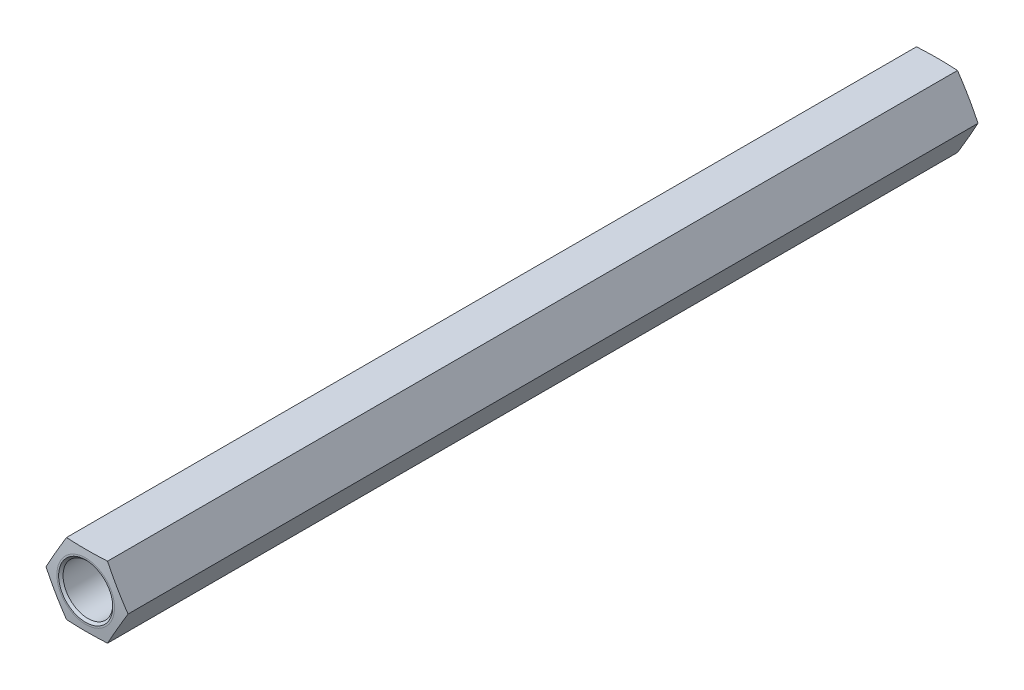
ISO-10303-21;
HEADER;
FILE_DESCRIPTION(('STEP AP214'),'2;1');
FILE_NAME('part.step','',(''),(''),'','','');
FILE_SCHEMA(('AUTOMOTIVE_DESIGN { 1 0 10303 214 1 1 1 1 }'));
ENDSEC;
DATA;
#1=APPLICATION_CONTEXT('core data for automotive mechanical design processes');
#2=APPLICATION_PROTOCOL_DEFINITION('international standard','automotive_design',2000,#1);
#3=PRODUCT_CONTEXT('',#1,'mechanical');
#4=PRODUCT('Part','Part','',(#3));
#5=PRODUCT_RELATED_PRODUCT_CATEGORY('part','',(#4));
#6=PRODUCT_DEFINITION_FORMATION('','',#4);
#7=PRODUCT_DEFINITION_CONTEXT('part definition',#1,'design');
#8=PRODUCT_DEFINITION('design','',#6,#7);
#9=PRODUCT_DEFINITION_SHAPE('','',#8);
#10=(LENGTH_UNIT() NAMED_UNIT(*) SI_UNIT(.MILLI.,.METRE.));
#11=(NAMED_UNIT(*) PLANE_ANGLE_UNIT() SI_UNIT($,.RADIAN.));
#12=(NAMED_UNIT(*) SI_UNIT($,.STERADIAN.) SOLID_ANGLE_UNIT());
#13=UNCERTAINTY_MEASURE_WITH_UNIT(LENGTH_MEASURE(1.E-05),#10,'distance_accuracy_value','');
#14=(GEOMETRIC_REPRESENTATION_CONTEXT(3) GLOBAL_UNCERTAINTY_ASSIGNED_CONTEXT((#13)) GLOBAL_UNIT_ASSIGNED_CONTEXT((#10,
#11,#12)) REPRESENTATION_CONTEXT('',''));
#15=CARTESIAN_POINT('',(0.,0.,0.));
#16=DIRECTION('',(0.,0.,1.));
#17=DIRECTION('',(1.,0.,0.));
#18=AXIS2_PLACEMENT_3D('',#15,#16,#17);
#19=CARTESIAN_POINT('',(3.6427233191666E-08,6.34999999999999,38.1));
#20=DIRECTION('',(0.,0.,-1.));
#21=DIRECTION('',(-1.,0.,0.));
#22=AXIS2_PLACEMENT_3D('',#19,#20,#21);
#23=PLANE('',#22);
#24=CARTESIAN_POINT('',(0.,-6.30938595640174E-08,38.1));
#25=DIRECTION('',(0.,0.,1.));
#26=DIRECTION('',(1.,0.,0.));
#27=AXIS2_PLACEMENT_3D('',#24,#25,#26);
#28=CIRCLE('',#27,2.57273925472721);
#29=CARTESIAN_POINT('',(2.57273925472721,-6.30938595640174E-08,38.1));
#30=VERTEX_POINT('',#29);
#31=EDGE_CURVE('E102',#30,#30,#28,.T.);
#32=ORIENTED_EDGE('',*,*,#31,.T.);
#33=EDGE_LOOP('',(#32));
#34=FACE_BOUND('',#33,.T.);
#35=CARTESIAN_POINT('',(0.,-6.30938595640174E-08,38.1));
#36=DIRECTION('',(0.,0.,-1.));
#37=DIRECTION('',(-1.,0.,0.));
#38=AXIS2_PLACEMENT_3D('',#35,#36,#37);
#39=CIRCLE('',#38,2.42000000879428);
#40=CARTESIAN_POINT('',(-2.42000000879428,-6.30938595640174E-08,38.1));
#41=VERTEX_POINT('',#40);
#42=EDGE_CURVE('E124',#41,#41,#39,.T.);
#43=ORIENTED_EDGE('',*,*,#42,.T.);
#44=EDGE_LOOP('',(#43));
#45=FACE_BOUND('',#44,.T.);
#46=ADVANCED_FACE('F30',(#34,#45),#23,.F.);
#47=CARTESIAN_POINT('',(3.6427233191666E-08,6.34999999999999,-38.1));
#48=DIRECTION('',(0.,0.,-1.));
#49=DIRECTION('',(-1.,0.,0.));
#50=AXIS2_PLACEMENT_3D('',#47,#48,#49);
#51=PLANE('',#50);
#52=CARTESIAN_POINT('',(0.,-6.30938595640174E-08,-38.1));
#53=DIRECTION('',(0.,0.,1.));
#54=DIRECTION('',(1.,0.,0.));
#55=AXIS2_PLACEMENT_3D('',#52,#53,#54);
#56=CIRCLE('',#55,2.57273925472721);
#57=CARTESIAN_POINT('',(2.57273925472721,-6.30938595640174E-08,-38.1));
#58=VERTEX_POINT('',#57);
#59=EDGE_CURVE('E222',#58,#58,#56,.T.);
#60=ORIENTED_EDGE('',*,*,#59,.F.);
#61=EDGE_LOOP('',(#60));
#62=FACE_BOUND('',#61,.T.);
#63=CARTESIAN_POINT('',(0.,-6.30938595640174E-08,-38.1));
#64=DIRECTION('',(0.,0.,-1.));
#65=DIRECTION('',(-1.,0.,0.));
#66=AXIS2_PLACEMENT_3D('',#63,#64,#65);
#67=CIRCLE('',#66,2.42000000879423);
#68=CARTESIAN_POINT('',(-2.42000000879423,-6.30938595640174E-08,-38.1));
#69=VERTEX_POINT('',#68);
#70=EDGE_CURVE('E127',#69,#69,#67,.F.);
#71=ORIENTED_EDGE('',*,*,#70,.T.);
#72=EDGE_LOOP('',(#71));
#73=FACE_BOUND('',#72,.T.);
#74=ADVANCED_FACE('F144',(#62,#73),#51,.T.);
#75=CARTESIAN_POINT('',(-1.83308710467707,3.17499993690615,38.1));
#76=DIRECTION('',(0.866025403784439,-0.5,0.));
#77=DIRECTION('',(0.5,0.866025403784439,0.));
#78=AXIS2_PLACEMENT_3D('',#75,#76,#77);
#79=PLANE('',#78);
#80=DIRECTION('',(0.,0.,-1.));
#81=VECTOR('',#80,1.);
#82=CARTESIAN_POINT('',(-3.66617420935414,-6.30938550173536E-08,38.1));
#83=LINE('',#82,#81);
#84=CARTESIAN_POINT('',(-3.66617420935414,-6.30938550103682E-08,37.98));
#85=VERTEX_POINT('',#84);
#86=CARTESIAN_POINT('',(-3.66617420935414,-6.30938550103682E-08,-37.98));
#87=VERTEX_POINT('',#86);
#88=EDGE_CURVE('E116',#85,#87,#83,.T.);
#89=ORIENTED_EDGE('',*,*,#88,.F.);
#90=CARTESIAN_POINT('',(-3.66628967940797,-0.000200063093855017,37.9799873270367));
#91=CARTESIAN_POINT('',(-3.58994462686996,0.132033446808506,37.9883701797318));
#92=CARTESIAN_POINT('',(-3.51357601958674,0.264307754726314,37.9959650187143));
#93=CARTESIAN_POINT('',(-3.36079345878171,0.528934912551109,38.0092901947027));
#94=CARTESIAN_POINT('',(-3.28437950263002,0.661287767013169,38.0150204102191));
#95=CARTESIAN_POINT('',(-3.13158459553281,0.925936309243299,38.0243226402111));
#96=CARTESIAN_POINT('',(-3.05520367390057,1.05823194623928,38.0278965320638));
#97=CARTESIAN_POINT('',(-2.90242538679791,1.32285170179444,38.0326873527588));
#98=CARTESIAN_POINT('',(-2.82602802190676,1.45517581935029,38.0339043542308));
#99=CARTESIAN_POINT('',(-2.67323329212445,1.719824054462,38.0339043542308));
#100=CARTESIAN_POINT('',(-2.5968359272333,1.85214817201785,38.0326873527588));
#101=CARTESIAN_POINT('',(-2.44405764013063,2.11676792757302,38.0278965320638));
#102=CARTESIAN_POINT('',(-2.36767671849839,2.249063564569,38.0243226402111));
#103=CARTESIAN_POINT('',(-2.21488181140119,2.51371210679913,38.0150204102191));
#104=CARTESIAN_POINT('',(-2.1384678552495,2.64606496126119,38.0092901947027));
#105=CARTESIAN_POINT('',(-1.98568529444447,2.91069211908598,37.9959650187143));
#106=CARTESIAN_POINT('',(-1.90931668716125,3.04296642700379,37.9883701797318));
#107=CARTESIAN_POINT('',(-1.83297163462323,3.17519993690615,37.9799873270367));
#108=B_SPLINE_CURVE_WITH_KNOTS('',3,(#90,#91,#92,#93,#94,#95,#96,#97,#98,#99,#100,#101,#102,
#103,#104,#105,#106,#107),.UNSPECIFIED.,.F.,.F.,(4,2,2,2,2,2,2,2,4),(0.,0.458763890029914,
0.917557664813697,1.37595141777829,1.83433104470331,2.29271067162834,2.75110442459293,
3.20989819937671,3.66866208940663),.UNSPECIFIED.);
#109=CARTESIAN_POINT('',(-1.83308710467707,3.17499993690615,37.98));
#110=VERTEX_POINT('',#109);
#111=EDGE_CURVE('E187',#85,#110,#108,.T.);
#112=ORIENTED_EDGE('',*,*,#111,.T.);
#113=DIRECTION('',(0.,0.,-1.));
#114=VECTOR('',#113,1.);
#115=CARTESIAN_POINT('',(-1.83308710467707,3.17499993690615,38.1));
#116=LINE('',#115,#114);
#117=CARTESIAN_POINT('',(-1.83308710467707,3.17499993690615,-37.98));
#118=VERTEX_POINT('',#117);
#119=EDGE_CURVE('E57',#110,#118,#116,.T.);
#120=ORIENTED_EDGE('',*,*,#119,.T.);
#121=CARTESIAN_POINT('',(-1.83297163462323,3.17519993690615,-37.9799873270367));
#122=CARTESIAN_POINT('',(-1.90931668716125,3.04296642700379,-37.9883701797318));
#123=CARTESIAN_POINT('',(-1.98568529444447,2.91069211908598,-37.9959650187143));
#124=CARTESIAN_POINT('',(-2.1384678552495,2.64606496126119,-38.0092901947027));
#125=CARTESIAN_POINT('',(-2.21488181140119,2.51371210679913,-38.0150204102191));
#126=CARTESIAN_POINT('',(-2.36767671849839,2.249063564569,-38.0243226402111));
#127=CARTESIAN_POINT('',(-2.44405764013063,2.11676792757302,-38.0278965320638));
#128=CARTESIAN_POINT('',(-2.5968359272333,1.85214817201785,-38.0326873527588));
#129=CARTESIAN_POINT('',(-2.67323329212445,1.719824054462,-38.0339043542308));
#130=CARTESIAN_POINT('',(-2.82602802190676,1.45517581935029,-38.0339043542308));
#131=CARTESIAN_POINT('',(-2.90242538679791,1.32285170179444,-38.0326873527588));
#132=CARTESIAN_POINT('',(-3.05520367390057,1.05823194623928,-38.0278965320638));
#133=CARTESIAN_POINT('',(-3.13158459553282,0.925936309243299,-38.0243226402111));
#134=CARTESIAN_POINT('',(-3.28437950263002,0.661287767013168,-38.0150204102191));
#135=CARTESIAN_POINT('',(-3.36079345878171,0.528934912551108,-38.0092901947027));
#136=CARTESIAN_POINT('',(-3.51357601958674,0.264307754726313,-37.9959650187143));
#137=CARTESIAN_POINT('',(-3.58994462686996,0.132033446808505,-37.9883701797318));
#138=CARTESIAN_POINT('',(-3.66628967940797,-0.000200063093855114,-37.9799873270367));
#139=B_SPLINE_CURVE_WITH_KNOTS('',3,(#121,#122,#123,#124,#125,#126,#127,#128,#129,#130,#131,
#132,#133,#134,#135,#136,#137,#138),.UNSPECIFIED.,.F.,.F.,(4,2,2,2,2,2,2,2,4),(0.,
0.458763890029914,0.917557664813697,1.37595141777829,1.83433104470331,2.29271067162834,
2.75110442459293,3.20989819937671,3.66866208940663),.UNSPECIFIED.);
#140=EDGE_CURVE('E209',#118,#87,#139,.T.);
#141=ORIENTED_EDGE('',*,*,#140,.T.);
#142=EDGE_LOOP('',(#89,#112,#120,#141));
#143=FACE_BOUND('',#142,.T.);
#144=ADVANCED_FACE('F196',(#143),#79,.F.);
#145=CARTESIAN_POINT('',(-3.66617420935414,-6.30938550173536E-08,38.1));
#146=DIRECTION('',(0.866025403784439,0.5,0.));
#147=DIRECTION('',(-0.5,0.866025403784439,0.));
#148=AXIS2_PLACEMENT_3D('',#145,#146,#147);
#149=PLANE('',#148);
#150=DIRECTION('',(0.,0.,-1.));
#151=VECTOR('',#150,1.);
#152=CARTESIAN_POINT('',(-1.83308710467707,-3.17500006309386,38.1));
#153=LINE('',#152,#151);
#154=CARTESIAN_POINT('',(-1.83308710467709,-3.17500006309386,37.98));
#155=VERTEX_POINT('',#154);
#156=CARTESIAN_POINT('',(-1.83308710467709,-3.17500006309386,-37.98));
#157=VERTEX_POINT('',#156);
#158=EDGE_CURVE('E110',#155,#157,#153,.T.);
#159=ORIENTED_EDGE('',*,*,#158,.F.);
#160=CARTESIAN_POINT('',(-1.83297163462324,-3.17520006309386,37.9799873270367));
#161=CARTESIAN_POINT('',(-1.90931668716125,-3.0429665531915,37.9883701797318));
#162=CARTESIAN_POINT('',(-1.98568529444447,-2.91069224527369,37.9959650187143));
#163=CARTESIAN_POINT('',(-2.1384678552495,-2.6460650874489,38.0092901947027));
#164=CARTESIAN_POINT('',(-2.21488181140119,-2.51371223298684,38.0150204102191));
#165=CARTESIAN_POINT('',(-2.36767671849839,-2.24906369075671,38.0243226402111));
#166=CARTESIAN_POINT('',(-2.44405764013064,-2.11676805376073,38.0278965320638));
#167=CARTESIAN_POINT('',(-2.5968359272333,-1.85214829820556,38.0326873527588));
#168=CARTESIAN_POINT('',(-2.67323329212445,-1.71982418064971,38.0339043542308));
#169=CARTESIAN_POINT('',(-2.82602802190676,-1.455175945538,38.0339043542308));
#170=CARTESIAN_POINT('',(-2.90242538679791,-1.32285182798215,38.0326873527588));
#171=CARTESIAN_POINT('',(-3.05520367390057,-1.05823207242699,38.0278965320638));
#172=CARTESIAN_POINT('',(-3.13158459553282,-0.925936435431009,38.0243226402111));
#173=CARTESIAN_POINT('',(-3.28437950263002,-0.661287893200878,38.0150204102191));
#174=CARTESIAN_POINT('',(-3.36079345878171,-0.528935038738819,38.0092901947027));
#175=CARTESIAN_POINT('',(-3.51357601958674,-0.264307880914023,37.9959650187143));
#176=CARTESIAN_POINT('',(-3.58994462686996,-0.132033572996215,37.9883701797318));
#177=CARTESIAN_POINT('',(-3.66628967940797,0.000199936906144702,37.9799873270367));
#178=B_SPLINE_CURVE_WITH_KNOTS('',3,(#160,#161,#162,#163,#164,#165,#166,#167,#168,#169,#170,
#171,#172,#173,#174,#175,#176,#177),.UNSPECIFIED.,.F.,.F.,(4,2,2,2,2,2,2,2,4),(0.,
0.458763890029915,0.917557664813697,1.37595141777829,1.83433104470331,2.29271067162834,
2.75110442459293,3.20989819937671,3.66866208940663),.UNSPECIFIED.);
#179=EDGE_CURVE('E181',#155,#85,#178,.T.);
#180=ORIENTED_EDGE('',*,*,#179,.T.);
#181=ORIENTED_EDGE('',*,*,#88,.T.);
#182=CARTESIAN_POINT('',(-3.66628967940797,0.000199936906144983,-37.9799873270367));
#183=CARTESIAN_POINT('',(-3.58994462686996,-0.132033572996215,-37.9883701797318));
#184=CARTESIAN_POINT('',(-3.51357601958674,-0.264307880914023,-37.9959650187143));
#185=CARTESIAN_POINT('',(-3.36079345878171,-0.528935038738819,-38.0092901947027));
#186=CARTESIAN_POINT('',(-3.28437950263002,-0.661287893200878,-38.0150204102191));
#187=CARTESIAN_POINT('',(-3.13158459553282,-0.925936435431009,-38.0243226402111));
#188=CARTESIAN_POINT('',(-3.05520367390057,-1.05823207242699,-38.0278965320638));
#189=CARTESIAN_POINT('',(-2.90242538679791,-1.32285182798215,-38.0326873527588));
#190=CARTESIAN_POINT('',(-2.82602802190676,-1.455175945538,-38.0339043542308));
#191=CARTESIAN_POINT('',(-2.67323329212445,-1.71982418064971,-38.0339043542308));
#192=CARTESIAN_POINT('',(-2.5968359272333,-1.85214829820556,-38.0326873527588));
#193=CARTESIAN_POINT('',(-2.44405764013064,-2.11676805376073,-38.0278965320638));
#194=CARTESIAN_POINT('',(-2.36767671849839,-2.24906369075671,-38.0243226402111));
#195=CARTESIAN_POINT('',(-2.21488181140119,-2.51371223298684,-38.0150204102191));
#196=CARTESIAN_POINT('',(-2.1384678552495,-2.6460650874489,-38.0092901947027));
#197=CARTESIAN_POINT('',(-1.98568529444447,-2.91069224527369,-37.9959650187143));
#198=CARTESIAN_POINT('',(-1.90931668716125,-3.0429665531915,-37.9883701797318));
#199=CARTESIAN_POINT('',(-1.83297163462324,-3.17520006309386,-37.9799873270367));
#200=B_SPLINE_CURVE_WITH_KNOTS('',3,(#182,#183,#184,#185,#186,#187,#188,#189,#190,#191,#192,
#193,#194,#195,#196,#197,#198,#199),.UNSPECIFIED.,.F.,.F.,(4,2,2,2,2,2,2,2,4),(0.,
0.458763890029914,0.917557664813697,1.37595141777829,1.83433104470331,2.29271067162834,
2.75110442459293,3.20989819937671,3.66866208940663),.UNSPECIFIED.);
#201=EDGE_CURVE('E202',#87,#157,#200,.T.);
#202=ORIENTED_EDGE('',*,*,#201,.T.);
#203=EDGE_LOOP('',(#159,#180,#181,#202));
#204=FACE_BOUND('',#203,.T.);
#205=ADVANCED_FACE('F192',(#204),#149,.F.);
#206=CARTESIAN_POINT('',(-1.83308710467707,-3.17500006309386,38.1));
#207=DIRECTION('',(-3.44194550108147E-08,0.999999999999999,0.));
#208=DIRECTION('',(-0.999999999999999,-3.44194550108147E-08,0.));
#209=AXIS2_PLACEMENT_3D('',#206,#207,#208);
#210=PLANE('',#209);
#211=DIRECTION('',(0.,0.,-1.));
#212=VECTOR('',#211,1.);
#213=CARTESIAN_POINT('',(1.83308710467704,-3.17499993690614,38.1));
#214=LINE('',#213,#212);
#215=CARTESIAN_POINT('',(1.83308699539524,-3.17500012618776,37.98));
#216=VERTEX_POINT('',#215);
#217=CARTESIAN_POINT('',(1.83308699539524,-3.17500012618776,-37.98));
#218=VERTEX_POINT('',#217);
#219=EDGE_CURVE('E108',#216,#218,#214,.T.);
#220=ORIENTED_EDGE('',*,*,#219,.F.);
#221=CARTESIAN_POINT('',(-4.83494791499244,-3.17500016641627,37.7475517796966));
#222=CARTESIAN_POINT('',(-4.69083344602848,-3.17500016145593,37.7607700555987));
#223=CARTESIAN_POINT('',(-4.54670317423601,-3.17500015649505,37.7738162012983));
#224=CARTESIAN_POINT('',(-4.25840335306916,-3.17500014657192,37.7994791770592));
#225=CARTESIAN_POINT('',(-4.11423380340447,-3.17500014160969,37.8120960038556));
#226=CARTESIAN_POINT('',(-3.68161123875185,-3.17500012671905,37.8491786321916));
#227=CARTESIAN_POINT('',(-3.39309105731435,-3.17500011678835,37.8728722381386));
#228=CARTESIAN_POINT('',(-2.81617995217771,-3.17500009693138,37.9171363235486));
#229=CARTESIAN_POINT('',(-2.52778933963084,-3.17500008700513,37.9377107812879));
#230=CARTESIAN_POINT('',(-1.95071438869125,-3.17500006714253,37.974212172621));
#231=CARTESIAN_POINT('',(-1.66203005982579,-3.17500005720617,37.9901392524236));
#232=CARTESIAN_POINT('',(-1.08383678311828,-3.17500003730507,38.0153055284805));
#233=CARTESIAN_POINT('',(-0.794327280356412,-3.17500002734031,38.0245328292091));
#234=CARTESIAN_POINT('',(-0.359965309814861,-3.17500001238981,38.0320264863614));
#235=CARTESIAN_POINT('',(-0.215165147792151,-3.17500000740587,38.0334665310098));
#236=CARTESIAN_POINT('',(0.0744404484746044,-3.1749999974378,38.0341710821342));
#237=CARTESIAN_POINT('',(0.219245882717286,-3.17499999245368,38.0334355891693));
#238=CARTESIAN_POINT('',(0.653794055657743,-3.17499997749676,38.0279910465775));
#239=CARTESIAN_POINT('',(0.943499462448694,-3.17499996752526,38.0200410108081));
#240=CARTESIAN_POINT('',(1.52263859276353,-3.17499994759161,37.9970571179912));
#241=CARTESIAN_POINT('',(1.8120722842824,-3.17499993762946,37.9820225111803));
#242=CARTESIAN_POINT('',(2.37658945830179,-3.17499991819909,37.9478298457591));
#243=CARTESIAN_POINT('',(2.65168769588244,-3.17499990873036,37.9289073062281));
#244=CARTESIAN_POINT('',(3.20165867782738,-3.17499988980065,37.8879990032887));
#245=CARTESIAN_POINT('',(3.47653141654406,-3.17499988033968,37.8660131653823));
#246=CARTESIAN_POINT('',(4.02611836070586,-3.1749998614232,37.819972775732));
#247=CARTESIAN_POINT('',(4.30083255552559,-3.17499985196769,37.7959180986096));
#248=CARTESIAN_POINT('',(4.85013324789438,-3.17499983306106,37.7463896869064));
#249=CARTESIAN_POINT('',(5.12471974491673,-3.17499982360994,37.7209159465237));
#250=CARTESIAN_POINT('',(5.67334348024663,-3.17499980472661,37.6690145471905));
#251=CARTESIAN_POINT('',(5.94738087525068,-3.17499979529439,37.6425885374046));
#252=CARTESIAN_POINT('',(6.49538629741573,-3.17499977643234,37.5890190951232));
#253=CARTESIAN_POINT('',(6.76935432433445,-3.17499976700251,37.561875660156));
#254=CARTESIAN_POINT('',(7.31716608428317,-3.17499974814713,37.5070676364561));
#255=CARTESIAN_POINT('',(7.59100983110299,-3.17499973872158,37.4794031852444));
#256=CARTESIAN_POINT('',(8.13865420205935,-3.17499971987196,37.4236676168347));
#257=CARTESIAN_POINT('',(8.4124548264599,-3.17499971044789,37.3955965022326));
#258=CARTESIAN_POINT('',(8.68624054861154,-3.17499970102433,37.367382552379));
#259=B_SPLINE_CURVE_WITH_KNOTS('',3,(#221,#222,#223,#224,#225,#226,#227,#228,#229,#230,#231,
#232,#233,#234,#235,#236,#237,#238,#239,#240,#241,#242,#243,#244,#245,#246,#247,#248,#249,#250,
#251,#252,#253,#254,#255,#256,#257,#258),.UNSPECIFIED.,.F.,.F.,(4,2,2,2,2,2,2,2,2,2,2,2,2,2,2,2,
2,2,4),(0.,0.434157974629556,0.868319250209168,1.73678265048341,2.60412888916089,
3.4714478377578,4.34030297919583,4.77470987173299,5.20911665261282,6.07843767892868,
6.94785072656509,7.7750713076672,8.60231200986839,9.42960288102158,10.2568971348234,
11.0828216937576,11.9087490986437,12.7344614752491,13.5601685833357),.UNSPECIFIED.);
#260=EDGE_CURVE('E90',#216,#155,#259,.F.);
#261=ORIENTED_EDGE('',*,*,#260,.T.);
#262=ORIENTED_EDGE('',*,*,#158,.T.);
#263=CARTESIAN_POINT('',(-4.83494791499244,-3.17500016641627,-37.7475517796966));
#264=CARTESIAN_POINT('',(-4.69083344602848,-3.17500016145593,-37.7607700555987));
#265=CARTESIAN_POINT('',(-4.54670317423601,-3.17500015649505,-37.7738162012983));
#266=CARTESIAN_POINT('',(-4.25840335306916,-3.17500014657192,-37.7994791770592));
#267=CARTESIAN_POINT('',(-4.11423380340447,-3.17500014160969,-37.8120960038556));
#268=CARTESIAN_POINT('',(-3.68161123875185,-3.17500012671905,-37.8491786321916));
#269=CARTESIAN_POINT('',(-3.39309105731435,-3.17500011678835,-37.8728722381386));
#270=CARTESIAN_POINT('',(-2.81617995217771,-3.17500009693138,-37.9171363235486));
#271=CARTESIAN_POINT('',(-2.52778933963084,-3.17500008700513,-37.9377107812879));
#272=CARTESIAN_POINT('',(-1.95071438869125,-3.17500006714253,-37.974212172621));
#273=CARTESIAN_POINT('',(-1.66203005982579,-3.17500005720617,-37.9901392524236));
#274=CARTESIAN_POINT('',(-1.08383678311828,-3.17500003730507,-38.0153055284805));
#275=CARTESIAN_POINT('',(-0.794327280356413,-3.17500002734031,-38.0245328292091));
#276=CARTESIAN_POINT('',(-0.359965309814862,-3.17500001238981,-38.0320264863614));
#277=CARTESIAN_POINT('',(-0.215165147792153,-3.17500000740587,-38.0334665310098));
#278=CARTESIAN_POINT('',(0.0744404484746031,-3.1749999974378,-38.0341710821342));
#279=CARTESIAN_POINT('',(0.219245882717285,-3.17499999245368,-38.0334355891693));
#280=CARTESIAN_POINT('',(0.653794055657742,-3.17499997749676,-38.0279910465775));
#281=CARTESIAN_POINT('',(0.943499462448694,-3.17499996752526,-38.0200410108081));
#282=CARTESIAN_POINT('',(1.52263859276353,-3.17499994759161,-37.9970571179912));
#283=CARTESIAN_POINT('',(1.8120722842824,-3.17499993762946,-37.9820225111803));
#284=CARTESIAN_POINT('',(2.37658945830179,-3.17499991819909,-37.9478298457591));
#285=CARTESIAN_POINT('',(2.65168769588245,-3.17499990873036,-37.9289073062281));
#286=CARTESIAN_POINT('',(3.20165867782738,-3.17499988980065,-37.8879990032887));
#287=CARTESIAN_POINT('',(3.47653141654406,-3.17499988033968,-37.8660131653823));
#288=CARTESIAN_POINT('',(4.02611836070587,-3.1749998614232,-37.819972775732));
#289=CARTESIAN_POINT('',(4.30083255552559,-3.17499985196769,-37.7959180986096));
#290=CARTESIAN_POINT('',(4.85013324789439,-3.17499983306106,-37.7463896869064));
#291=CARTESIAN_POINT('',(5.12471974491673,-3.17499982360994,-37.7209159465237));
#292=CARTESIAN_POINT('',(5.67334348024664,-3.17499980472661,-37.6690145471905));
#293=CARTESIAN_POINT('',(5.94738087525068,-3.17499979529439,-37.6425885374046));
#294=CARTESIAN_POINT('',(6.49538629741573,-3.17499977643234,-37.5890190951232));
#295=CARTESIAN_POINT('',(6.76935432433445,-3.17499976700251,-37.561875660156));
#296=CARTESIAN_POINT('',(7.31716608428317,-3.17499974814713,-37.5070676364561));
#297=CARTESIAN_POINT('',(7.59100983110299,-3.17499973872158,-37.4794031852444));
#298=CARTESIAN_POINT('',(8.13865420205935,-3.17499971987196,-37.4236676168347));
#299=CARTESIAN_POINT('',(8.4124548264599,-3.17499971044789,-37.3955965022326));
#300=CARTESIAN_POINT('',(8.68624054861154,-3.17499970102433,-37.367382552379));
#301=B_SPLINE_CURVE_WITH_KNOTS('',3,(#263,#264,#265,#266,#267,#268,#269,#270,#271,#272,#273,
#274,#275,#276,#277,#278,#279,#280,#281,#282,#283,#284,#285,#286,#287,#288,#289,#290,#291,#292,
#293,#294,#295,#296,#297,#298,#299,#300),.UNSPECIFIED.,.F.,.F.,(4,2,2,2,2,2,2,2,2,2,2,2,2,2,2,2,
2,2,4),(0.,0.434157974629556,0.868319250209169,1.73678265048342,2.60412888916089,
3.4714478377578,4.34030297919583,4.77470987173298,5.20911665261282,6.07843767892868,
6.94785072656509,7.7750713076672,8.60231200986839,9.42960288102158,10.2568971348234,
11.0828216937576,11.9087490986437,12.7344614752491,13.5601685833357),.UNSPECIFIED.);
#302=EDGE_CURVE('E210',#157,#218,#301,.T.);
#303=ORIENTED_EDGE('',*,*,#302,.T.);
#304=EDGE_LOOP('',(#220,#261,#262,#303));
#305=FACE_BOUND('',#304,.T.);
#306=ADVANCED_FACE('F195',(#305),#210,.F.);
#307=CARTESIAN_POINT('',(1.83308710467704,-3.17499993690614,38.1));
#308=DIRECTION('',(-0.866025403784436,0.500000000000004,0.));
#309=DIRECTION('',(-0.500000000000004,-0.866025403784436,0.));
#310=AXIS2_PLACEMENT_3D('',#307,#308,#309);
#311=PLANE('',#310);
#312=DIRECTION('',(0.,0.,-1.));
#313=VECTOR('',#312,1.);
#314=CARTESIAN_POINT('',(3.66617420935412,6.3093853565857E-08,38.1));
#315=LINE('',#314,#313);
#316=CARTESIAN_POINT('',(3.66617420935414,6.3093824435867E-08,37.98));
#317=VERTEX_POINT('',#316);
#318=CARTESIAN_POINT('',(3.66617420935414,6.3093824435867E-08,-37.98));
#319=VERTEX_POINT('',#318);
#320=EDGE_CURVE('E99',#317,#319,#315,.T.);
#321=ORIENTED_EDGE('',*,*,#320,.F.);
#322=CARTESIAN_POINT('',(3.66628967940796,0.000200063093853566,37.9799873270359));
#323=CARTESIAN_POINT('',(3.58994462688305,-0.132033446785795,37.9883701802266));
#324=CARTESIAN_POINT('',(3.51357601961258,-0.264307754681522,37.9959650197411));
#325=CARTESIAN_POINT('',(3.36079345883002,-0.528934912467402,38.0092901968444));
#326=CARTESIAN_POINT('',(3.28437950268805,-0.661287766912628,38.0150204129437));
#327=CARTESIAN_POINT('',(3.13158459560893,-0.925936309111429,38.0243226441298));
#328=CARTESIAN_POINT('',(3.05520367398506,-1.0582319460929,38.0278965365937));
#329=CARTESIAN_POINT('',(2.90242538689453,-1.32285170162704,38.0326873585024));
#330=CARTESIAN_POINT('',(2.82602802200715,-1.45517581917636,38.0339043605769));
#331=CARTESIAN_POINT('',(2.67323329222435,-1.71982405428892,38.0339043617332));
#332=CARTESIAN_POINT('',(2.59683592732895,-1.85214817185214,38.0326873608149));
#333=CARTESIAN_POINT('',(2.44405764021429,-2.11676792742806,38.0278965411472));
#334=CARTESIAN_POINT('',(2.36767671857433,-2.24906356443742,38.0243226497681));
#335=CARTESIAN_POINT('',(2.21488181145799,-2.51371210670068,38.0150204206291));
#336=CARTESIAN_POINT('',(2.1384678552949,-2.64606496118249,38.0092902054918));
#337=CARTESIAN_POINT('',(1.9856852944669,-2.91069211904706,37.9959650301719));
#338=CARTESIAN_POINT('',(1.90931668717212,-3.0429664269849,37.9883701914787));
#339=CARTESIAN_POINT('',(1.8329716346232,-3.17519993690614,37.9799873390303));
#340=B_SPLINE_CURVE_WITH_KNOTS('',3,(#322,#323,#324,#325,#326,#327,#328,#329,#330,#331,#332,
#333,#334,#335,#336,#337,#338,#339),.UNSPECIFIED.,.F.,.F.,(4,2,2,2,2,2,2,2,4),(0.,
0.458763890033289,0.917557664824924,1.37595141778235,1.8343310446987,2.29271067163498,
2.75110442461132,3.20989819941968,3.66866208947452),.UNSPECIFIED.);
#341=EDGE_CURVE('E87',#317,#216,#340,.T.);
#342=ORIENTED_EDGE('',*,*,#341,.T.);
#343=ORIENTED_EDGE('',*,*,#219,.T.);
#344=CARTESIAN_POINT('',(1.8329716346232,-3.17519993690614,-37.9799873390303));
#345=CARTESIAN_POINT('',(1.90931668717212,-3.0429664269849,-37.9883701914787));
#346=CARTESIAN_POINT('',(1.9856852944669,-2.91069211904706,-37.9959650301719));
#347=CARTESIAN_POINT('',(2.1384678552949,-2.64606496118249,-38.0092902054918));
#348=CARTESIAN_POINT('',(2.21488181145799,-2.51371210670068,-38.0150204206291));
#349=CARTESIAN_POINT('',(2.36767671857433,-2.24906356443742,-38.0243226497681));
#350=CARTESIAN_POINT('',(2.44405764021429,-2.11676792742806,-38.0278965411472));
#351=CARTESIAN_POINT('',(2.59683592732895,-1.85214817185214,-38.0326873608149));
#352=CARTESIAN_POINT('',(2.67323329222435,-1.71982405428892,-38.0339043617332));
#353=CARTESIAN_POINT('',(2.82602802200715,-1.45517581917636,-38.0339043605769));
#354=CARTESIAN_POINT('',(2.90242538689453,-1.32285170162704,-38.0326873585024));
#355=CARTESIAN_POINT('',(3.05520367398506,-1.0582319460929,-38.0278965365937));
#356=CARTESIAN_POINT('',(3.13158459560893,-0.925936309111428,-38.0243226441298));
#357=CARTESIAN_POINT('',(3.28437950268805,-0.661287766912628,-38.0150204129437));
#358=CARTESIAN_POINT('',(3.36079345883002,-0.528934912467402,-38.0092901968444));
#359=CARTESIAN_POINT('',(3.51357601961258,-0.264307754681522,-37.9959650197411));
#360=CARTESIAN_POINT('',(3.58994462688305,-0.132033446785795,-37.9883701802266));
#361=CARTESIAN_POINT('',(3.66628967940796,0.000200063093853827,-37.9799873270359));
#362=B_SPLINE_CURVE_WITH_KNOTS('',3,(#344,#345,#346,#347,#348,#349,#350,#351,#352,#353,#354,
#355,#356,#357,#358,#359,#360,#361),.UNSPECIFIED.,.F.,.F.,(4,2,2,2,2,2,2,2,4),(0.,
0.458763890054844,0.917557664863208,1.37595141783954,1.83433104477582,2.29271067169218,
2.7511044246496,3.20989819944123,3.66866208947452),.UNSPECIFIED.);
#363=EDGE_CURVE('E107',#218,#319,#362,.T.);
#364=ORIENTED_EDGE('',*,*,#363,.T.);
#365=EDGE_LOOP('',(#321,#342,#343,#364));
#366=FACE_BOUND('',#365,.T.);
#367=ADVANCED_FACE('F105',(#366),#311,.F.);
#368=CARTESIAN_POINT('',(3.66617420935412,6.3093853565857E-08,38.1));
#369=DIRECTION('',(-0.866025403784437,-0.500000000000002,0.));
#370=DIRECTION('',(0.500000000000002,-0.866025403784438,0.));
#371=AXIS2_PLACEMENT_3D('',#368,#369,#370);
#372=PLANE('',#371);
#373=DIRECTION('',(0.,0.,-1.));
#374=VECTOR('',#373,1.);
#375=CARTESIAN_POINT('',(1.83308710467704,3.17500006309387,38.1));
#376=LINE('',#375,#374);
#377=CARTESIAN_POINT('',(1.83308710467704,3.17500006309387,37.9799999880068));
#378=VERTEX_POINT('',#377);
#379=CARTESIAN_POINT('',(1.83308688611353,3.17500006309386,-37.98));
#380=VERTEX_POINT('',#379);
#381=EDGE_CURVE('E101',#378,#380,#376,.T.);
#382=ORIENTED_EDGE('',*,*,#381,.F.);
#383=CARTESIAN_POINT('',(1.8329716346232,3.17520006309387,37.9799873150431));
#384=CARTESIAN_POINT('',(1.90931668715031,3.04296655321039,37.9883701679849));
#385=CARTESIAN_POINT('',(1.98568529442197,2.91069224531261,37.9959650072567));
#386=CARTESIAN_POINT('',(2.13846785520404,2.64606508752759,38.0092901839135));
#387=CARTESIAN_POINT('',(2.21488181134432,2.51371223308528,38.0150203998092));
#388=CARTESIAN_POINT('',(2.3676767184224,2.24906369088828,38.0243226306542));
#389=CARTESIAN_POINT('',(2.44405764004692,2.11676805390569,38.0278965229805));
#390=CARTESIAN_POINT('',(2.5968359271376,1.85214829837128,38.0326873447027));
#391=CARTESIAN_POINT('',(2.6732332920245,1.71982418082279,38.0339043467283));
#392=CARTESIAN_POINT('',(2.82602802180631,1.45517594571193,38.0339043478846));
#393=CARTESIAN_POINT('',(2.90242538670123,1.32285182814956,38.0326873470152));
#394=CARTESIAN_POINT('',(3.05520367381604,1.05823207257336,38.027896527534));
#395=CARTESIAN_POINT('',(3.13158459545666,0.925936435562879,38.0243226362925));
#396=CARTESIAN_POINT('',(3.28437950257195,0.661287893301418,38.0150204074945));
#397=CARTESIAN_POINT('',(3.36079345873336,0.528935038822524,38.009290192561));
#398=CARTESIAN_POINT('',(3.51357601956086,0.264307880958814,37.9959650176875));
#399=CARTESIAN_POINT('',(3.58994462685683,0.132033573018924,37.988370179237));
#400=CARTESIAN_POINT('',(3.66628967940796,-0.00019993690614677,37.9799873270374));
#401=B_SPLINE_CURVE_WITH_KNOTS('',3,(#383,#384,#385,#386,#387,#388,#389,#390,#391,#392,#393,
#394,#395,#396,#397,#398,#399,#400),.UNSPECIFIED.,.F.,.F.,(4,2,2,2,2,2,2,2,4),(0.,
0.458763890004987,0.917557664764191,1.37595141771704,1.83433104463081,2.29271067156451,
2.75110442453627,3.20989819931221,3.66866208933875),.UNSPECIFIED.);
#402=EDGE_CURVE('E50',#378,#317,#401,.T.);
#403=ORIENTED_EDGE('',*,*,#402,.T.);
#404=ORIENTED_EDGE('',*,*,#320,.T.);
#405=CARTESIAN_POINT('',(3.66628967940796,-0.000199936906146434,-37.9799873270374));
#406=CARTESIAN_POINT('',(3.58994462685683,0.132033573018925,-37.988370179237));
#407=CARTESIAN_POINT('',(3.51357601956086,0.264307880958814,-37.9959650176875));
#408=CARTESIAN_POINT('',(3.36079345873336,0.528935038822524,-38.009290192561));
#409=CARTESIAN_POINT('',(3.28437950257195,0.661287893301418,-38.0150204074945));
#410=CARTESIAN_POINT('',(3.13158459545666,0.925936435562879,-38.0243226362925));
#411=CARTESIAN_POINT('',(3.05520367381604,1.05823207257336,-38.027896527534));
#412=CARTESIAN_POINT('',(2.90242538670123,1.32285182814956,-38.0326873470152));
#413=CARTESIAN_POINT('',(2.82602802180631,1.45517594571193,-38.0339043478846));
#414=CARTESIAN_POINT('',(2.6732332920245,1.71982418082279,-38.0339043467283));
#415=CARTESIAN_POINT('',(2.5968359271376,1.85214829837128,-38.0326873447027));
#416=CARTESIAN_POINT('',(2.44405764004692,2.11676805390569,-38.0278965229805));
#417=CARTESIAN_POINT('',(2.3676767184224,2.24906369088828,-38.0243226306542));
#418=CARTESIAN_POINT('',(2.21488181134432,2.51371223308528,-38.0150203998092));
#419=CARTESIAN_POINT('',(2.13846785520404,2.64606508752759,-38.0092901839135));
#420=CARTESIAN_POINT('',(1.98568529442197,2.91069224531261,-37.9959650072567));
#421=CARTESIAN_POINT('',(1.90931668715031,3.04296655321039,-37.9883701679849));
#422=CARTESIAN_POINT('',(1.8329716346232,3.17520006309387,-37.9799873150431));
#423=B_SPLINE_CURVE_WITH_KNOTS('',3,(#405,#406,#407,#408,#409,#410,#411,#412,#413,#414,#415,
#416,#417,#418,#419,#420,#421,#422),.UNSPECIFIED.,.F.,.F.,(4,2,2,2,2,2,2,2,4),(0.,
0.45876389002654,0.917557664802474,1.37595141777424,1.83433104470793,2.2927106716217,
2.75110442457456,3.20989819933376,3.66866208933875),.UNSPECIFIED.);
#424=EDGE_CURVE('E154',#319,#380,#423,.T.);
#425=ORIENTED_EDGE('',*,*,#424,.T.);
#426=EDGE_LOOP('',(#382,#403,#404,#425));
#427=FACE_BOUND('',#426,.T.);
#428=ADVANCED_FACE('F97',(#427),#372,.F.);
#429=CARTESIAN_POINT('',(1.83308710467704,3.17500006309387,38.1));
#430=DIRECTION('',(3.44194550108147E-08,-0.999999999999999,0.));
#431=DIRECTION('',(0.999999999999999,3.44194550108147E-08,0.));
#432=AXIS2_PLACEMENT_3D('',#429,#430,#431);
#433=PLANE('',#432);
#434=ORIENTED_EDGE('',*,*,#119,.F.);
#435=CARTESIAN_POINT('',(-4.8349521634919,3.17499983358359,37.7475514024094));
#436=CARTESIAN_POINT('',(-4.69083751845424,3.17499983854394,37.7607696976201));
#437=CARTESIAN_POINT('',(-4.54670707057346,3.17499984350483,37.7738158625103));
#438=CARTESIAN_POINT('',(-4.25840689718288,3.17499985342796,37.799478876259));
#439=CARTESIAN_POINT('',(-4.11423717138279,3.17499985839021,37.8120957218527));
#440=CARTESIAN_POINT('',(-3.68161407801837,3.17499987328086,37.8491784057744));
#441=CARTESIAN_POINT('',(-3.39309354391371,3.17499988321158,37.8728720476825));
#442=CARTESIAN_POINT('',(-2.81618173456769,3.17499990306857,37.9171362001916));
#443=CARTESIAN_POINT('',(-2.52779077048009,3.17499991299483,37.9377106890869));
#444=CARTESIAN_POINT('',(-1.95071511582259,3.17499993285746,37.9742121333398));
#445=CARTESIAN_POINT('',(-1.66203043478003,3.17499994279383,37.9901392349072));
#446=CARTESIAN_POINT('',(-1.08383644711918,3.17499996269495,38.0153055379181));
#447=CARTESIAN_POINT('',(-0.794326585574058,3.17499997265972,38.0245328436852));
#448=CARTESIAN_POINT('',(-0.359964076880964,3.17499998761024,38.0320264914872));
#449=CARTESIAN_POINT('',(-0.21516373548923,3.17499999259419,38.0334665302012));
#450=CARTESIAN_POINT('',(0.0744422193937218,3.17500000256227,38.0341710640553));
#451=CARTESIAN_POINT('',(0.219247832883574,3.1750000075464,38.0334355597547));
#452=CARTESIAN_POINT('',(0.653796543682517,3.17500002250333,38.0279909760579));
#453=CARTESIAN_POINT('',(0.943502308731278,3.17500003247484,38.0200409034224));
#454=CARTESIAN_POINT('',(1.52264215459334,3.17500005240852,37.9970569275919));
#455=CARTESIAN_POINT('',(1.81207620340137,3.17500006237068,37.9820222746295));
#456=CARTESIAN_POINT('',(2.37659373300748,3.17500008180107,37.9478295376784));
#457=CARTESIAN_POINT('',(2.6516919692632,3.1750000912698,37.9289069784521));
#458=CARTESIAN_POINT('',(3.20166294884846,3.1750001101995,37.8879986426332));
#459=CARTESIAN_POINT('',(3.47653568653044,3.17500011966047,37.8660127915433));
#460=CARTESIAN_POINT('',(4.02612262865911,3.17500013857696,37.8199723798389));
#461=CARTESIAN_POINT('',(4.30083682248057,3.17500014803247,37.795917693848));
#462=CARTESIAN_POINT('',(4.85013751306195,3.1750001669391,37.7463892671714));
#463=CARTESIAN_POINT('',(5.12472400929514,3.17500017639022,37.720915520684));
#464=CARTESIAN_POINT('',(5.67334774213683,3.17500019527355,37.6690141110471));
#465=CARTESIAN_POINT('',(5.94738513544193,3.17500020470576,37.6425880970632));
#466=CARTESIAN_POINT('',(6.49539055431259,3.17500022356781,37.5890186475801));
#467=CARTESIAN_POINT('',(6.76935857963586,3.17500023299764,37.5618752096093));
#468=CARTESIAN_POINT('',(7.3171703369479,3.17500025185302,37.507067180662));
#469=CARTESIAN_POINT('',(7.59101408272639,3.17500026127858,37.4794027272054));
#470=CARTESIAN_POINT('',(8.13865845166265,3.1750002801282,37.4236671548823));
#471=CARTESIAN_POINT('',(8.41245907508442,3.17500028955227,37.3955960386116));
#472=CARTESIAN_POINT('',(8.68624479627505,3.17500029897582,37.367382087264));
#473=B_SPLINE_CURVE_WITH_KNOTS('',3,(#435,#436,#437,#438,#439,#440,#441,#442,#443,#444,#445,
#446,#447,#448,#449,#450,#451,#452,#453,#454,#455,#456,#457,#458,#459,#460,#461,#462,#463,#464,
#465,#466,#467,#468,#469,#470,#471,#472),.UNSPECIFIED.,.F.,.F.,(4,2,2,2,2,2,2,2,2,2,2,2,2,2,2,2,
2,2,4),(0.,0.434158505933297,0.868320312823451,1.73678477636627,2.60413207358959,
3.4714520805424,4.34030829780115,4.77471572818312,5.20912304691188,6.07844515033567,
6.94785927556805,7.77507985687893,8.60232055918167,9.42961142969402,10.2569056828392,
11.0828302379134,11.908757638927,12.7344700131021,13.5601771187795),.UNSPECIFIED.);
#474=EDGE_CURVE('E11',#110,#378,#473,.T.);
#475=ORIENTED_EDGE('',*,*,#474,.T.);
#476=ORIENTED_EDGE('',*,*,#381,.T.);
#477=CARTESIAN_POINT('',(-4.8349521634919,3.17499983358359,-37.7475514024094));
#478=CARTESIAN_POINT('',(-4.69083751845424,3.17499983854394,-37.7607696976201));
#479=CARTESIAN_POINT('',(-4.54670707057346,3.17499984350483,-37.7738158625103));
#480=CARTESIAN_POINT('',(-4.25840689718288,3.17499985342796,-37.799478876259));
#481=CARTESIAN_POINT('',(-4.11423717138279,3.17499985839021,-37.8120957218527));
#482=CARTESIAN_POINT('',(-3.68161407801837,3.17499987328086,-37.8491784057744));
#483=CARTESIAN_POINT('',(-3.39309354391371,3.17499988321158,-37.8728720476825));
#484=CARTESIAN_POINT('',(-2.81618173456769,3.17499990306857,-37.9171362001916));
#485=CARTESIAN_POINT('',(-2.52779077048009,3.17499991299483,-37.9377106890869));
#486=CARTESIAN_POINT('',(-1.95071511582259,3.17499993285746,-37.9742121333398));
#487=CARTESIAN_POINT('',(-1.66203043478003,3.17499994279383,-37.9901392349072));
#488=CARTESIAN_POINT('',(-1.08383644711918,3.17499996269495,-38.0153055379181));
#489=CARTESIAN_POINT('',(-0.794326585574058,3.17499997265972,-38.0245328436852));
#490=CARTESIAN_POINT('',(-0.359964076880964,3.17499998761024,-38.0320264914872));
#491=CARTESIAN_POINT('',(-0.21516373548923,3.17499999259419,-38.0334665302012));
#492=CARTESIAN_POINT('',(0.0744422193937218,3.17500000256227,-38.0341710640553));
#493=CARTESIAN_POINT('',(0.219247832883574,3.1750000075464,-38.0334355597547));
#494=CARTESIAN_POINT('',(0.653796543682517,3.17500002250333,-38.0279909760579));
#495=CARTESIAN_POINT('',(0.943502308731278,3.17500003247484,-38.0200409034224));
#496=CARTESIAN_POINT('',(1.52264215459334,3.17500005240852,-37.9970569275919));
#497=CARTESIAN_POINT('',(1.81207620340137,3.17500006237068,-37.9820222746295));
#498=CARTESIAN_POINT('',(2.37659373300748,3.17500008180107,-37.9478295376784));
#499=CARTESIAN_POINT('',(2.6516919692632,3.1750000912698,-37.9289069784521));
#500=CARTESIAN_POINT('',(3.20166294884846,3.1750001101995,-37.8879986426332));
#501=CARTESIAN_POINT('',(3.47653568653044,3.17500011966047,-37.8660127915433));
#502=CARTESIAN_POINT('',(4.02612262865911,3.17500013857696,-37.8199723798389));
#503=CARTESIAN_POINT('',(4.30083682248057,3.17500014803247,-37.795917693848));
#504=CARTESIAN_POINT('',(4.85013751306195,3.1750001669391,-37.7463892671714));
#505=CARTESIAN_POINT('',(5.12472400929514,3.17500017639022,-37.720915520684));
#506=CARTESIAN_POINT('',(5.67334774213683,3.17500019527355,-37.6690141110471));
#507=CARTESIAN_POINT('',(5.94738513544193,3.17500020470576,-37.6425880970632));
#508=CARTESIAN_POINT('',(6.49539055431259,3.17500022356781,-37.5890186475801));
#509=CARTESIAN_POINT('',(6.76935857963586,3.17500023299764,-37.5618752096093));
#510=CARTESIAN_POINT('',(7.3171703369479,3.17500025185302,-37.507067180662));
#511=CARTESIAN_POINT('',(7.59101408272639,3.17500026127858,-37.4794027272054));
#512=CARTESIAN_POINT('',(8.13865845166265,3.1750002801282,-37.4236671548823));
#513=CARTESIAN_POINT('',(8.41245907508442,3.17500028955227,-37.3955960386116));
#514=CARTESIAN_POINT('',(8.68624479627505,3.17500029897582,-37.367382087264));
#515=B_SPLINE_CURVE_WITH_KNOTS('',3,(#477,#478,#479,#480,#481,#482,#483,#484,#485,#486,#487,
#488,#489,#490,#491,#492,#493,#494,#495,#496,#497,#498,#499,#500,#501,#502,#503,#504,#505,#506,
#507,#508,#509,#510,#511,#512,#513,#514),.UNSPECIFIED.,.F.,.F.,(4,2,2,2,2,2,2,2,2,2,2,2,2,2,2,2,
2,2,4),(0.,0.434158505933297,0.868320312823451,1.73678477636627,2.60413207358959,
3.4714520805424,4.34030829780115,4.77471572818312,5.20912304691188,6.07844515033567,
6.94785927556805,7.77507985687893,8.60232055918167,9.42961142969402,10.2569056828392,
11.0828302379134,11.908757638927,12.7344700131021,13.5601771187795),.UNSPECIFIED.);
#516=EDGE_CURVE('E43',#380,#118,#515,.F.);
#517=ORIENTED_EDGE('',*,*,#516,.T.);
#518=EDGE_LOOP('',(#434,#475,#476,#517));
#519=FACE_BOUND('',#518,.T.);
#520=ADVANCED_FACE('F137',(#519),#433,.F.);
#521=CARTESIAN_POINT('',(0.,-6.30938595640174E-08,38.1));
#522=DIRECTION('',(0.,0.,-1.));
#523=DIRECTION('',(-1.,0.,0.));
#524=AXIS2_PLACEMENT_3D('',#521,#522,#523);
#525=CYLINDRICAL_SURFACE('',#524,2.22000000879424);
#526=CARTESIAN_POINT('',(0.,-6.30938595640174E-08,37.9));
#527=DIRECTION('',(0.,0.,-1.));
#528=DIRECTION('',(-1.,0.,0.));
#529=AXIS2_PLACEMENT_3D('',#526,#527,#528);
#530=CIRCLE('',#529,2.22000000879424);
#531=CARTESIAN_POINT('',(-2.22000000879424,-6.30938595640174E-08,37.9));
#532=VERTEX_POINT('',#531);
#533=EDGE_CURVE('E121',#532,#532,#530,.F.);
#534=CARTESIAN_POINT('',(0.,-6.30938595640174E-08,-37.9));
#535=DIRECTION('',(0.,0.,-1.));
#536=DIRECTION('',(-1.,0.,0.));
#537=AXIS2_PLACEMENT_3D('',#534,#535,#536);
#538=CIRCLE('',#537,2.22000000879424);
#539=CARTESIAN_POINT('',(-2.22000000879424,-6.30938595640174E-08,-37.9));
#540=VERTEX_POINT('',#539);
#541=EDGE_CURVE('E118',#540,#540,#538,.T.);
#542=CARTESIAN_POINT('',(-2.22000000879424,-6.30938595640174E-08,37.9));
#543=CARTESIAN_POINT('',(-2.22000000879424,-6.30938595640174E-08,37.1104166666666));
#544=CARTESIAN_POINT('',(-2.22000000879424,-6.30938595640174E-08,36.3208333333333));
#545=CARTESIAN_POINT('',(-2.22000000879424,-6.30938595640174E-08,34.7416666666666));
#546=CARTESIAN_POINT('',(-2.22000000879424,-6.30938595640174E-08,33.9520833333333));
#547=CARTESIAN_POINT('',(-2.22000000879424,-6.30938595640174E-08,32.3729166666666));
#548=CARTESIAN_POINT('',(-2.22000000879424,-6.30938595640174E-08,31.5833333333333));
#549=CARTESIAN_POINT('',(-2.22000000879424,-6.30938595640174E-08,30.0041666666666));
#550=CARTESIAN_POINT('',(-2.22000000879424,-6.30938595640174E-08,29.2145833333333));
#551=CARTESIAN_POINT('',(-2.22000000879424,-6.30938595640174E-08,27.6354166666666));
#552=CARTESIAN_POINT('',(-2.22000000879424,-6.30938595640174E-08,26.8458333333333));
#553=CARTESIAN_POINT('',(-2.22000000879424,-6.30938595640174E-08,25.2666666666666));
#554=CARTESIAN_POINT('',(-2.22000000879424,-6.30938595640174E-08,24.4770833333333));
#555=CARTESIAN_POINT('',(-2.22000000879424,-6.30938595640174E-08,22.8979166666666));
#556=CARTESIAN_POINT('',(-2.22000000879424,-6.30938595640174E-08,22.1083333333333));
#557=CARTESIAN_POINT('',(-2.22000000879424,-6.30938595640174E-08,20.5291666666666));
#558=CARTESIAN_POINT('',(-2.22000000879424,-6.30938595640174E-08,19.7395833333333));
#559=CARTESIAN_POINT('',(-2.22000000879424,-6.30938595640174E-08,18.1604166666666));
#560=CARTESIAN_POINT('',(-2.22000000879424,-6.30938595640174E-08,17.3708333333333));
#561=CARTESIAN_POINT('',(-2.22000000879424,-6.30938595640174E-08,15.7916666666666));
#562=CARTESIAN_POINT('',(-2.22000000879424,-6.30938595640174E-08,15.0020833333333));
#563=CARTESIAN_POINT('',(-2.22000000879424,-6.30938595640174E-08,13.4229166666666));
#564=CARTESIAN_POINT('',(-2.22000000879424,-6.30938595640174E-08,12.6333333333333));
#565=CARTESIAN_POINT('',(-2.22000000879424,-6.30938595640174E-08,11.0541666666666));
#566=CARTESIAN_POINT('',(-2.22000000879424,-6.30938595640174E-08,10.2645833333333));
#567=CARTESIAN_POINT('',(-2.22000000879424,-6.30938595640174E-08,8.68541666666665));
#568=CARTESIAN_POINT('',(-2.22000000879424,-6.30938595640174E-08,7.89583333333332));
#569=CARTESIAN_POINT('',(-2.22000000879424,-6.30938595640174E-08,6.31666666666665));
#570=CARTESIAN_POINT('',(-2.22000000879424,-6.30938595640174E-08,5.52708333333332));
#571=CARTESIAN_POINT('',(-2.22000000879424,-6.30938595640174E-08,3.94791666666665));
#572=CARTESIAN_POINT('',(-2.22000000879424,-6.30938595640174E-08,3.15833333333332));
#573=CARTESIAN_POINT('',(-2.22000000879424,-6.30938595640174E-08,1.57916666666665));
#574=CARTESIAN_POINT('',(-2.22000000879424,-6.30938595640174E-08,0.78958333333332));
#575=CARTESIAN_POINT('',(-2.22000000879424,-6.30938595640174E-08,-0.789583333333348));
#576=CARTESIAN_POINT('',(-2.22000000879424,-6.30938595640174E-08,-1.57916666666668));
#577=CARTESIAN_POINT('',(-2.22000000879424,-6.30938595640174E-08,-3.15833333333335));
#578=CARTESIAN_POINT('',(-2.22000000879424,-6.30938595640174E-08,-3.94791666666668));
#579=CARTESIAN_POINT('',(-2.22000000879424,-6.30938595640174E-08,-5.52708333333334));
#580=CARTESIAN_POINT('',(-2.22000000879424,-6.30938595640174E-08,-6.31666666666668));
#581=CARTESIAN_POINT('',(-2.22000000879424,-6.30938595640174E-08,-7.89583333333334));
#582=CARTESIAN_POINT('',(-2.22000000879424,-6.30938595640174E-08,-8.68541666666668));
#583=CARTESIAN_POINT('',(-2.22000000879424,-6.30938595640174E-08,-10.2645833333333));
#584=CARTESIAN_POINT('',(-2.22000000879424,-6.30938595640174E-08,-11.0541666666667));
#585=CARTESIAN_POINT('',(-2.22000000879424,-6.30938595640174E-08,-12.6333333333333));
#586=CARTESIAN_POINT('',(-2.22000000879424,-6.30938595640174E-08,-13.4229166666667));
#587=CARTESIAN_POINT('',(-2.22000000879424,-6.30938595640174E-08,-15.0020833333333));
#588=CARTESIAN_POINT('',(-2.22000000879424,-6.30938595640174E-08,-15.7916666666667));
#589=CARTESIAN_POINT('',(-2.22000000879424,-6.30938595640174E-08,-17.3708333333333));
#590=CARTESIAN_POINT('',(-2.22000000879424,-6.30938595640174E-08,-18.1604166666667));
#591=CARTESIAN_POINT('',(-2.22000000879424,-6.30938595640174E-08,-19.7395833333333));
#592=CARTESIAN_POINT('',(-2.22000000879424,-6.30938595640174E-08,-20.5291666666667));
#593=CARTESIAN_POINT('',(-2.22000000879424,-6.30938595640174E-08,-22.1083333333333));
#594=CARTESIAN_POINT('',(-2.22000000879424,-6.30938595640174E-08,-22.8979166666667));
#595=CARTESIAN_POINT('',(-2.22000000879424,-6.30938595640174E-08,-24.4770833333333));
#596=CARTESIAN_POINT('',(-2.22000000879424,-6.30938595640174E-08,-25.2666666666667));
#597=CARTESIAN_POINT('',(-2.22000000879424,-6.30938595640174E-08,-26.8458333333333));
#598=CARTESIAN_POINT('',(-2.22000000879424,-6.30938595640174E-08,-27.6354166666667));
#599=CARTESIAN_POINT('',(-2.22000000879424,-6.30938595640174E-08,-29.2145833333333));
#600=CARTESIAN_POINT('',(-2.22000000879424,-6.30938595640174E-08,-30.0041666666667));
#601=CARTESIAN_POINT('',(-2.22000000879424,-6.30938595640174E-08,-31.5833333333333));
#602=CARTESIAN_POINT('',(-2.22000000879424,-6.30938595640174E-08,-32.3729166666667));
#603=CARTESIAN_POINT('',(-2.22000000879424,-6.30938595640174E-08,-33.9520833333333));
#604=CARTESIAN_POINT('',(-2.22000000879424,-6.30938595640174E-08,-34.7416666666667));
#605=CARTESIAN_POINT('',(-2.22000000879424,-6.30938595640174E-08,-36.3208333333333));
#606=CARTESIAN_POINT('',(-2.22000000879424,-6.30938595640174E-08,-37.1104166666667));
#607=CARTESIAN_POINT('',(-2.22000000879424,-6.30938595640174E-08,-37.9));
#608=B_SPLINE_CURVE_WITH_KNOTS('',3,(#542,#543,#544,#545,#546,#547,#548,#549,#550,#551,#552,
#553,#554,#555,#556,#557,#558,#559,#560,#561,#562,#563,#564,#565,#566,#567,#568,#569,#570,#571,
#572,#573,#574,#575,#576,#577,#578,#579,#580,#581,#582,#583,#584,#585,#586,#587,#588,#589,#590,
#591,#592,#593,#594,#595,#596,#597,#598,#599,#600,#601,#602,#603,#604,#605,#606,#607),
.UNSPECIFIED.,.F.,.F.,(4,2,2,2,2,2,2,2,2,2,2,2,2,2,2,2,2,2,2,2,2,2,2,2,2,2,2,2,2,2,2,2,4),(0.,
2.36875,4.73749999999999,7.10624999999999,9.47499999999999,11.84375,14.2125,16.58125,18.95,
21.31875,23.6875,26.05625,28.425,30.79375,33.1625,35.53125,37.9,40.26875,42.6375,45.00625,
47.375,49.74375,52.1125,54.48125,56.85,59.21875,61.5875,63.95625,66.325,68.69375,71.0625,
73.43125,75.8),.UNSPECIFIED.);
#609=EDGE_CURVE('BSEAM142',#532,#540,#608,.T.);
#610=ORIENTED_EDGE('',*,*,#533,.T.);
#611=ORIENTED_EDGE('',*,*,#541,.T.);
#612=ORIENTED_EDGE('',*,*,#609,.T.);
#613=ORIENTED_EDGE('',*,*,#609,.F.);
#614=EDGE_LOOP('',(#610,#612,#611,#613));
#615=FACE_BOUND('',#614,.T.);
#616=ADVANCED_FACE('F142',(#615),#525,.F.);
#617=CARTESIAN_POINT('',(0.,-6.30938595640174E-08,37.9));
#618=DIRECTION('',(0.,0.,1.));
#619=DIRECTION('',(1.,0.,0.));
#620=AXIS2_PLACEMENT_3D('',#617,#618,#619);
#621=CONICAL_SURFACE('',#620,2.22000000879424,0.785398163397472);
#622=ORIENTED_EDGE('',*,*,#42,.F.);
#623=EDGE_LOOP('',(#622));
#624=FACE_BOUND('',#623,.T.);
#625=ORIENTED_EDGE('',*,*,#533,.F.);
#626=EDGE_LOOP('',(#625));
#627=FACE_BOUND('',#626,.T.);
#628=ADVANCED_FACE('F245',(#624,#627),#621,.F.);
#629=CARTESIAN_POINT('',(0.,-6.30938595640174E-08,-38.1));
#630=DIRECTION('',(0.,0.,-1.));
#631=DIRECTION('',(-1.,0.,0.));
#632=AXIS2_PLACEMENT_3D('',#629,#630,#631);
#633=CONICAL_SURFACE('',#632,2.42000000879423,0.785398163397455);
#634=ORIENTED_EDGE('',*,*,#541,.F.);
#635=EDGE_LOOP('',(#634));
#636=FACE_BOUND('',#635,.T.);
#637=ORIENTED_EDGE('',*,*,#70,.F.);
#638=EDGE_LOOP('',(#637));
#639=FACE_BOUND('',#638,.T.);
#640=ADVANCED_FACE('F32',(#636,#639),#633,.F.);
#641=CARTESIAN_POINT('',(0.,-6.30938595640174E-08,-38.1));
#642=DIRECTION('',(0.,0.,1.));
#643=DIRECTION('',(1.,0.,0.));
#644=AXIS2_PLACEMENT_3D('',#641,#642,#643);
#645=CONICAL_SURFACE('',#644,2.57273925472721,1.4614878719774);
#646=ORIENTED_EDGE('',*,*,#59,.T.);
#647=EDGE_LOOP('',(#646));
#648=FACE_BOUND('',#647,.T.);
#649=ORIENTED_EDGE('',*,*,#516,.F.);
#650=ORIENTED_EDGE('',*,*,#424,.F.);
#651=ORIENTED_EDGE('',*,*,#363,.F.);
#652=ORIENTED_EDGE('',*,*,#302,.F.);
#653=ORIENTED_EDGE('',*,*,#201,.F.);
#654=ORIENTED_EDGE('',*,*,#140,.F.);
#655=EDGE_LOOP('',(#649,#650,#651,#652,#653,#654));
#656=FACE_BOUND('',#655,.T.);
#657=ADVANCED_FACE('F134',(#648,#656),#645,.T.);
#658=CARTESIAN_POINT('',(0.,-6.30938595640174E-08,38.1));
#659=DIRECTION('',(0.,0.,-1.));
#660=DIRECTION('',(1.,0.,0.));
#661=AXIS2_PLACEMENT_3D('',#658,#659,#660);
#662=CONICAL_SURFACE('',#661,2.57273925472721,1.4614878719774);
#663=ORIENTED_EDGE('',*,*,#31,.F.);
#664=EDGE_LOOP('',(#663));
#665=FACE_BOUND('',#664,.T.);
#666=ORIENTED_EDGE('',*,*,#179,.F.);
#667=ORIENTED_EDGE('',*,*,#260,.F.);
#668=ORIENTED_EDGE('',*,*,#341,.F.);
#669=ORIENTED_EDGE('',*,*,#402,.F.);
#670=ORIENTED_EDGE('',*,*,#474,.F.);
#671=ORIENTED_EDGE('',*,*,#111,.F.);
#672=EDGE_LOOP('',(#666,#667,#668,#669,#670,#671));
#673=FACE_BOUND('',#672,.T.);
#674=ADVANCED_FACE('F88',(#665,#673),#662,.T.);
#675=CLOSED_SHELL('',(#46,#74,#144,#205,#306,#367,#428,#520,#616,#628,#640,#657,#674));
#676=MANIFOLD_SOLID_BREP('B2',#675);
#677=ADVANCED_BREP_SHAPE_REPRESENTATION('',(#18,#676),#14);
#678=SHAPE_DEFINITION_REPRESENTATION(#9,#677);
ENDSEC;
END-ISO-10303-21;
